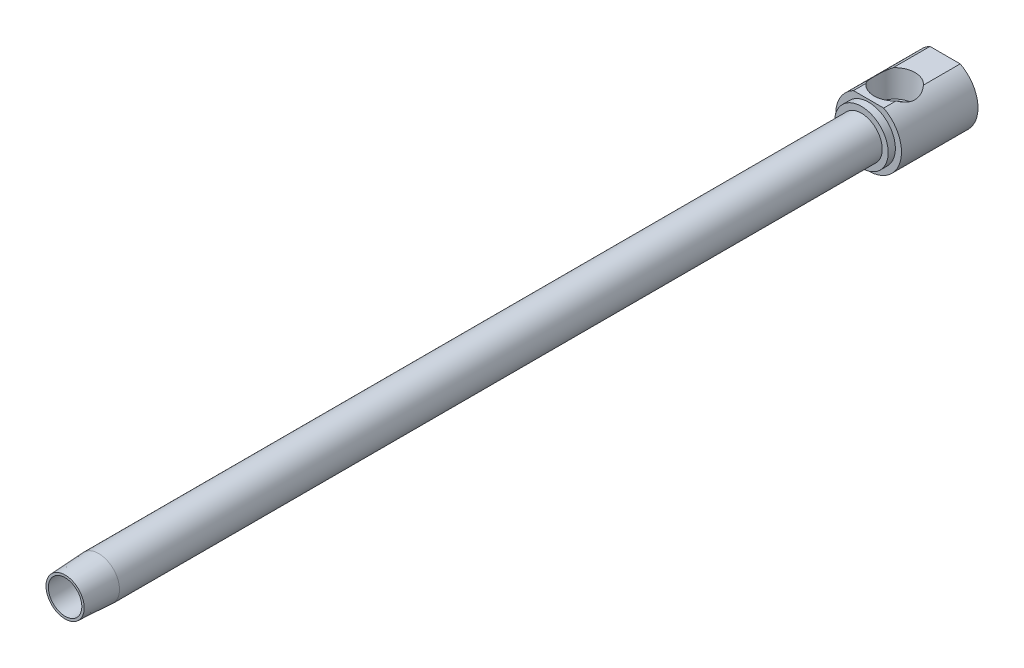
ISO-10303-21;
HEADER;
FILE_DESCRIPTION(('STEP AP214'),'2;1');
FILE_NAME('part.step','',(''),(''),'','','');
FILE_SCHEMA(('AUTOMOTIVE_DESIGN { 1 0 10303 214 1 1 1 1 }'));
ENDSEC;
DATA;
#1=APPLICATION_CONTEXT('core data for automotive mechanical design processes');
#2=APPLICATION_PROTOCOL_DEFINITION('international standard','automotive_design',2000,#1);
#3=PRODUCT_CONTEXT('',#1,'mechanical');
#4=PRODUCT('Part','Part','',(#3));
#5=PRODUCT_RELATED_PRODUCT_CATEGORY('part','',(#4));
#6=PRODUCT_DEFINITION_FORMATION('','',#4);
#7=PRODUCT_DEFINITION_CONTEXT('part definition',#1,'design');
#8=PRODUCT_DEFINITION('design','',#6,#7);
#9=PRODUCT_DEFINITION_SHAPE('','',#8);
#10=(LENGTH_UNIT() NAMED_UNIT(*) SI_UNIT(.MILLI.,.METRE.));
#11=(NAMED_UNIT(*) PLANE_ANGLE_UNIT() SI_UNIT($,.RADIAN.));
#12=(NAMED_UNIT(*) SI_UNIT($,.STERADIAN.) SOLID_ANGLE_UNIT());
#13=UNCERTAINTY_MEASURE_WITH_UNIT(LENGTH_MEASURE(1.E-05),#10,'distance_accuracy_value','');
#14=(GEOMETRIC_REPRESENTATION_CONTEXT(3) GLOBAL_UNCERTAINTY_ASSIGNED_CONTEXT((#13)) GLOBAL_UNIT_ASSIGNED_CONTEXT((#10,
#11,#12)) REPRESENTATION_CONTEXT('',''));
#15=CARTESIAN_POINT('',(0.,0.,0.));
#16=DIRECTION('',(0.,0.,1.));
#17=DIRECTION('',(1.,0.,0.));
#18=AXIS2_PLACEMENT_3D('',#15,#16,#17);
#19=CARTESIAN_POINT('',(0.,0.,-326.022166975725));
#20=DIRECTION('',(0.,0.,-1.));
#21=DIRECTION('',(-1.,0.,0.));
#22=AXIS2_PLACEMENT_3D('',#19,#20,#21);
#23=CYLINDRICAL_SURFACE('',#22,6.9215);
#24=CARTESIAN_POINT('',(0.,0.,-11.147200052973));
#25=DIRECTION('',(0.,0.,-1.));
#26=DIRECTION('',(-1.,0.,0.));
#27=AXIS2_PLACEMENT_3D('',#24,#25,#26);
#28=CIRCLE('',#27,6.9215);
#29=CARTESIAN_POINT('',(-6.9215,0.,-11.147200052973));
#30=VERTEX_POINT('',#29);
#31=EDGE_CURVE('E260',#30,#30,#28,.T.);
#32=ORIENTED_EDGE('',*,*,#31,.T.);
#33=EDGE_LOOP('',(#32));
#34=FACE_BOUND('',#33,.T.);
#35=CARTESIAN_POINT('',(0.,0.,-264.3124));
#36=DIRECTION('',(0.,0.,-1.));
#37=DIRECTION('',(-1.,0.,0.));
#38=AXIS2_PLACEMENT_3D('',#35,#36,#37);
#39=CIRCLE('',#38,6.9215);
#40=CARTESIAN_POINT('',(-6.9215,0.,-264.3124));
#41=VERTEX_POINT('',#40);
#42=EDGE_CURVE('E230',#41,#41,#39,.T.);
#43=ORIENTED_EDGE('',*,*,#42,.F.);
#44=EDGE_LOOP('',(#43));
#45=FACE_BOUND('',#44,.T.);
#46=ADVANCED_FACE('F15',(#34,#45),#23,.T.);
#47=CARTESIAN_POINT('',(-5.0165,9.70179425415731,-250.825));
#48=DIRECTION('',(0.,-1.,0.));
#49=DIRECTION('',(0.,0.,-1.));
#50=AXIS2_PLACEMENT_3D('',#47,#48,#49);
#51=PLANE('',#50);
#52=DIRECTION('',(0.,0.,-1.));
#53=VECTOR('',#52,1.);
#54=CARTESIAN_POINT('',(5.0165,9.70179425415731,-250.825));
#55=LINE('',#54,#53);
#56=CARTESIAN_POINT('',(5.0165,9.70179425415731,-266.7));
#57=VERTEX_POINT('',#56);
#58=CARTESIAN_POINT('',(5.0165,9.70179425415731,-270.78066390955));
#59=VERTEX_POINT('',#58);
#60=EDGE_CURVE('E222',#57,#59,#55,.T.);
#61=ORIENTED_EDGE('',*,*,#60,.T.);
#62=CARTESIAN_POINT('',(0.,9.70179425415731,-275.336));
#63=DIRECTION('',(0.,-1.,0.));
#64=DIRECTION('',(0.,0.,-1.));
#65=AXIS2_PLACEMENT_3D('',#62,#63,#64);
#66=CIRCLE('',#65,6.77616109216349);
#67=CARTESIAN_POINT('',(-5.0165,9.70179425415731,-270.78066390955));
#68=VERTEX_POINT('',#67);
#69=EDGE_CURVE('E10',#59,#68,#66,.T.);
#70=ORIENTED_EDGE('',*,*,#69,.T.);
#71=DIRECTION('',(0.,0.,-1.));
#72=VECTOR('',#71,1.);
#73=CARTESIAN_POINT('',(-5.0165,9.70179425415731,-250.825));
#74=LINE('',#73,#72);
#75=CARTESIAN_POINT('',(-5.0165,9.70179425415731,-266.7));
#76=VERTEX_POINT('',#75);
#77=EDGE_CURVE('E229',#76,#68,#74,.T.);
#78=ORIENTED_EDGE('',*,*,#77,.F.);
#79=DIRECTION('',(1.,0.,0.));
#80=VECTOR('',#79,1.);
#81=CARTESIAN_POINT('',(-8.89,9.70179425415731,-266.7));
#82=LINE('',#81,#80);
#83=EDGE_CURVE('E192',#76,#57,#82,.T.);
#84=ORIENTED_EDGE('',*,*,#83,.T.);
#85=EDGE_LOOP('',(#61,#70,#78,#84));
#86=FACE_BOUND('',#85,.T.);
#87=ADVANCED_FACE('F128',(#86),#51,.F.);
#88=CARTESIAN_POINT('',(-5.55625,0.,-264.287));
#89=DIRECTION('',(0.,0.,1.));
#90=DIRECTION('',(1.,0.,0.));
#91=AXIS2_PLACEMENT_3D('',#88,#89,#90);
#92=PLANE('',#91);
#93=CARTESIAN_POINT('',(0.,0.,-264.287));
#94=DIRECTION('',(0.,0.,-1.));
#95=DIRECTION('',(-1.,0.,0.));
#96=AXIS2_PLACEMENT_3D('',#93,#94,#95);
#97=CIRCLE('',#96,5.55625);
#98=CARTESIAN_POINT('',(-5.55625,0.,-264.287));
#99=VERTEX_POINT('',#98);
#100=EDGE_CURVE('E243',#99,#99,#97,.T.);
#101=ORIENTED_EDGE('',*,*,#100,.F.);
#102=EDGE_LOOP('',(#101));
#103=FACE_BOUND('',#102,.T.);
#104=CARTESIAN_POINT('',(0.,-0.00757924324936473,-264.287));
#105=DIRECTION('',(0.,0.,1.));
#106=DIRECTION('',(0.,1.,0.));
#107=AXIS2_PLACEMENT_3D('',#104,#105,#106);
#108=ELLIPSE('',#107,5.22919092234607,4.47866855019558);
#109=CARTESIAN_POINT('',(0.,5.22161167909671,-264.287));
#110=VERTEX_POINT('',#109);
#111=EDGE_CURVE('E193',#110,#110,#108,.F.);
#112=ORIENTED_EDGE('',*,*,#111,.T.);
#113=EDGE_LOOP('',(#112));
#114=FACE_BOUND('',#113,.T.);
#115=ADVANCED_FACE('F134',(#103,#114),#92,.T.);
#116=CARTESIAN_POINT('',(-5.55625,0.,0.));
#117=DIRECTION('',(0.,0.,1.));
#118=DIRECTION('',(1.,0.,0.));
#119=AXIS2_PLACEMENT_3D('',#116,#117,#118);
#120=PLANE('',#119);
#121=CARTESIAN_POINT('',(0.,0.,0.));
#122=DIRECTION('',(0.,0.,-1.));
#123=DIRECTION('',(-1.,0.,0.));
#124=AXIS2_PLACEMENT_3D('',#121,#122,#123);
#125=CIRCLE('',#124,6.3373);
#126=CARTESIAN_POINT('',(-6.3373,0.,0.));
#127=VERTEX_POINT('',#126);
#128=EDGE_CURVE('E257',#127,#127,#125,.T.);
#129=ORIENTED_EDGE('',*,*,#128,.F.);
#130=EDGE_LOOP('',(#129));
#131=FACE_BOUND('',#130,.T.);
#132=CARTESIAN_POINT('',(0.,0.,0.));
#133=DIRECTION('',(0.,0.,-1.));
#134=DIRECTION('',(-1.,0.,0.));
#135=AXIS2_PLACEMENT_3D('',#132,#133,#134);
#136=CIRCLE('',#135,5.55625);
#137=CARTESIAN_POINT('',(-5.55625,0.,0.));
#138=VERTEX_POINT('',#137);
#139=EDGE_CURVE('E19',#138,#138,#136,.T.);
#140=ORIENTED_EDGE('',*,*,#139,.T.);
#141=EDGE_LOOP('',(#140));
#142=FACE_BOUND('',#141,.T.);
#143=ADVANCED_FACE('F17',(#131,#142),#120,.T.);
#144=CARTESIAN_POINT('',(0.,0.,-326.022166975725));
#145=DIRECTION('',(0.,0.,-1.));
#146=DIRECTION('',(-1.,0.,0.));
#147=AXIS2_PLACEMENT_3D('',#144,#145,#146);
#148=CYLINDRICAL_SURFACE('',#147,5.55625);
#149=ORIENTED_EDGE('',*,*,#100,.T.);
#150=EDGE_LOOP('',(#149));
#151=FACE_BOUND('',#150,.T.);
#152=ORIENTED_EDGE('',*,*,#139,.F.);
#153=EDGE_LOOP('',(#152));
#154=FACE_BOUND('',#153,.T.);
#155=ADVANCED_FACE('F141',(#151,#154),#148,.F.);
#156=CARTESIAN_POINT('',(-10.922,0.,-292.1));
#157=DIRECTION('',(0.,0.,-1.));
#158=DIRECTION('',(-1.,0.,0.));
#159=AXIS2_PLACEMENT_3D('',#156,#157,#158);
#160=PLANE('',#159);
#161=DIRECTION('',(1.,0.,0.));
#162=VECTOR('',#161,1.);
#163=CARTESIAN_POINT('',(-2.7496306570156,4.7625,-292.1));
#164=LINE('',#163,#162);
#165=CARTESIAN_POINT('',(-2.7496306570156,4.7625,-292.1));
#166=VERTEX_POINT('',#165);
#167=CARTESIAN_POINT('',(2.7496306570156,4.7625,-292.1));
#168=VERTEX_POINT('',#167);
#169=EDGE_CURVE('E353',#166,#168,#164,.T.);
#170=ORIENTED_EDGE('',*,*,#169,.F.);
#171=DIRECTION('',(0.5,0.866025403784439,0.));
#172=VECTOR('',#171,1.);
#173=CARTESIAN_POINT('',(-5.49926131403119,0.,-292.1));
#174=LINE('',#173,#172);
#175=CARTESIAN_POINT('',(-5.49926131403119,0.,-292.1));
#176=VERTEX_POINT('',#175);
#177=EDGE_CURVE('E338',#176,#166,#174,.T.);
#178=ORIENTED_EDGE('',*,*,#177,.F.);
#179=DIRECTION('',(-0.5,0.866025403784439,0.));
#180=VECTOR('',#179,1.);
#181=CARTESIAN_POINT('',(-2.7496306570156,-4.7625,-292.1));
#182=LINE('',#181,#180);
#183=CARTESIAN_POINT('',(-2.7496306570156,-4.7625,-292.1));
#184=VERTEX_POINT('',#183);
#185=EDGE_CURVE('E342',#184,#176,#182,.T.);
#186=ORIENTED_EDGE('',*,*,#185,.F.);
#187=DIRECTION('',(-1.,0.,0.));
#188=VECTOR('',#187,1.);
#189=CARTESIAN_POINT('',(2.74963065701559,-4.7625,-292.1));
#190=LINE('',#189,#188);
#191=CARTESIAN_POINT('',(2.74963065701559,-4.7625,-292.1));
#192=VERTEX_POINT('',#191);
#193=EDGE_CURVE('E361',#192,#184,#190,.T.);
#194=ORIENTED_EDGE('',*,*,#193,.F.);
#195=DIRECTION('',(-0.5,-0.866025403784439,0.));
#196=VECTOR('',#195,1.);
#197=CARTESIAN_POINT('',(5.49926131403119,0.,-292.1));
#198=LINE('',#197,#196);
#199=CARTESIAN_POINT('',(5.49926131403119,0.,-292.1));
#200=VERTEX_POINT('',#199);
#201=EDGE_CURVE('E358',#200,#192,#198,.T.);
#202=ORIENTED_EDGE('',*,*,#201,.F.);
#203=DIRECTION('',(0.5,-0.866025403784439,0.));
#204=VECTOR('',#203,1.);
#205=CARTESIAN_POINT('',(2.7496306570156,4.7625,-292.1));
#206=LINE('',#205,#204);
#207=EDGE_CURVE('E355',#168,#200,#206,.T.);
#208=ORIENTED_EDGE('',*,*,#207,.F.);
#209=EDGE_LOOP('',(#170,#178,#186,#194,#202,#208));
#210=FACE_BOUND('',#209,.T.);
#211=DIRECTION('',(-1.,0.,0.));
#212=VECTOR('',#211,1.);
#213=CARTESIAN_POINT('',(-5.0165,9.70179425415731,-292.1));
#214=LINE('',#213,#212);
#215=CARTESIAN_POINT('',(5.0165,9.70179425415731,-292.1));
#216=VERTEX_POINT('',#215);
#217=CARTESIAN_POINT('',(-5.0165,9.70179425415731,-292.1));
#218=VERTEX_POINT('',#217);
#219=EDGE_CURVE('E223',#216,#218,#214,.T.);
#220=ORIENTED_EDGE('',*,*,#219,.F.);
#221=CARTESIAN_POINT('',(0.,0.,-292.1));
#222=DIRECTION('',(0.,0.,-1.));
#223=DIRECTION('',(-1.,0.,0.));
#224=AXIS2_PLACEMENT_3D('',#221,#222,#223);
#225=CIRCLE('',#224,10.922);
#226=EDGE_CURVE('E221',#216,#218,#225,.T.);
#227=ORIENTED_EDGE('',*,*,#226,.T.);
#228=EDGE_LOOP('',(#220,#227));
#229=FACE_BOUND('',#228,.T.);
#230=ADVANCED_FACE('F144',(#210,#229),#160,.T.);
#231=CARTESIAN_POINT('',(0.,0.,-326.022166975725));
#232=DIRECTION('',(0.,0.,-1.));
#233=DIRECTION('',(-1.,0.,0.));
#234=AXIS2_PLACEMENT_3D('',#231,#232,#233);
#235=CYLINDRICAL_SURFACE('',#234,10.922);
#236=CARTESIAN_POINT('',(5.01611318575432,9.70199425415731,-270.780222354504));
#237=CARTESIAN_POINT('',(5.13874600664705,9.63860171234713,-270.920215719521));
#238=CARTESIAN_POINT('',(5.25564164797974,9.57520664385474,-271.065256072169));
#239=CARTESIAN_POINT('',(5.47752086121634,9.45002813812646,-271.364981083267));
#240=CARTESIAN_POINT('',(5.58249714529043,9.38824570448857,-271.519671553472));
#241=CARTESIAN_POINT('',(5.78097274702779,9.26736711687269,-271.839725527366));
#242=CARTESIAN_POINT('',(5.8743418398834,9.20830544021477,-272.00518303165));
#243=CARTESIAN_POINT('',(6.04766375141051,9.09541327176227,-272.344678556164));
#244=CARTESIAN_POINT('',(6.12761848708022,9.04158203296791,-272.518715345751));
#245=CARTESIAN_POINT('',(6.27379640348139,8.94077724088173,-272.875643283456));
#246=CARTESIAN_POINT('',(6.33993919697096,8.89384428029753,-273.058579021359));
#247=CARTESIAN_POINT('',(6.45706504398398,8.80917858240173,-273.431294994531));
#248=CARTESIAN_POINT('',(6.50805163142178,8.7714437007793,-273.621073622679));
#249=CARTESIAN_POINT('',(6.59383346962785,8.70714156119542,-274.005114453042));
#250=CARTESIAN_POINT('',(6.62870831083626,8.68051947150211,-274.199349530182));
#251=CARTESIAN_POINT('',(6.68193856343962,8.63961377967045,-274.591343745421));
#252=CARTESIAN_POINT('',(6.70029794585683,8.6253272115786,-274.789102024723));
#253=CARTESIAN_POINT('',(6.71863048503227,8.61105017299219,-275.15650037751));
#254=CARTESIAN_POINT('',(6.72092722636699,8.6092532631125,-275.325959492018));
#255=CARTESIAN_POINT('',(6.71322085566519,8.61526418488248,-275.664414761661));
#256=CARTESIAN_POINT('',(6.70321892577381,8.6230710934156,-275.833410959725));
#257=CARTESIAN_POINT('',(6.67106070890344,8.64797346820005,-276.169752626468));
#258=CARTESIAN_POINT('',(6.64888985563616,8.66508006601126,-276.337095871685));
#259=CARTESIAN_POINT('',(6.59274566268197,8.70787088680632,-276.668631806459));
#260=CARTESIAN_POINT('',(6.55877214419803,8.73355523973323,-276.832824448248));
#261=CARTESIAN_POINT('',(6.44503992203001,8.81817206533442,-277.297696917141));
#262=CARTESIAN_POINT('',(6.35112179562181,8.88662503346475,-277.593302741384));
#263=CARTESIAN_POINT('',(6.1270275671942,9.04257250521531,-278.164869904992));
#264=CARTESIAN_POINT('',(5.99683851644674,9.13007380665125,-278.440824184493));
#265=CARTESIAN_POINT('',(5.73165005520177,9.2982747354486,-278.918944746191));
#266=CARTESIAN_POINT('',(5.60244827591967,9.37701803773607,-279.125061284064));
#267=CARTESIAN_POINT('',(5.32402625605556,9.53785679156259,-279.520821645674));
#268=CARTESIAN_POINT('',(5.1748707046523,9.61994083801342,-279.710515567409));
#269=CARTESIAN_POINT('',(5.01611318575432,9.70199425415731,-279.891777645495));
#270=B_SPLINE_CURVE_WITH_KNOTS('',3,(#236,#237,#238,#239,#240,#241,#242,#243,#244,#245,#246,
#247,#248,#249,#250,#251,#252,#253,#254,#255,#256,#257,#258,#259,#260,#261,#262,#263,#264,#265,
#266,#267,#268,#269),.UNSPECIFIED.,.F.,.F.,(4,2,2,2,2,2,2,2,2,2,2,2,2,2,2,2,4),(0.,
0.589708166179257,1.17977497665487,1.77595731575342,2.37205438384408,2.97152964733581,
3.57086502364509,4.16720722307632,4.7634059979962,5.2711570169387,5.77885923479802,
6.28717050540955,6.79548947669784,7.7444750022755,8.69379975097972,9.45956340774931,
10.222902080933),.UNSPECIFIED.);
#271=CARTESIAN_POINT('',(5.0165,9.70179425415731,-279.891336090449));
#272=VERTEX_POINT('',#271);
#273=EDGE_CURVE('E31',#59,#272,#270,.T.);
#274=ORIENTED_EDGE('',*,*,#273,.F.);
#275=ORIENTED_EDGE('',*,*,#60,.F.);
#276=CARTESIAN_POINT('',(0.,0.,-266.7));
#277=DIRECTION('',(0.,0.,-1.));
#278=DIRECTION('',(-1.,0.,0.));
#279=AXIS2_PLACEMENT_3D('',#276,#277,#278);
#280=CIRCLE('',#279,10.922);
#281=EDGE_CURVE('E239',#57,#76,#280,.T.);
#282=ORIENTED_EDGE('',*,*,#281,.T.);
#283=ORIENTED_EDGE('',*,*,#77,.T.);
#284=CARTESIAN_POINT('',(-5.01611318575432,9.70199425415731,-279.891777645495));
#285=CARTESIAN_POINT('',(-5.13874600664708,9.63860171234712,-279.751784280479));
#286=CARTESIAN_POINT('',(-5.25564164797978,9.57520664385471,-279.606743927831));
#287=CARTESIAN_POINT('',(-5.47752086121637,9.45002813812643,-279.307018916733));
#288=CARTESIAN_POINT('',(-5.58249714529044,9.38824570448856,-279.152328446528));
#289=CARTESIAN_POINT('',(-5.78097274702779,9.26736711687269,-278.832274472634));
#290=CARTESIAN_POINT('',(-5.8743418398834,9.20830544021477,-278.66681696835));
#291=CARTESIAN_POINT('',(-6.04766375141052,9.09541327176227,-278.327321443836));
#292=CARTESIAN_POINT('',(-6.12761848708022,9.04158203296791,-278.153284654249));
#293=CARTESIAN_POINT('',(-6.27379640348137,8.94077724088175,-277.796356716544));
#294=CARTESIAN_POINT('',(-6.33993919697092,8.89384428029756,-277.613420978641));
#295=CARTESIAN_POINT('',(-6.45706504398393,8.80917858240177,-277.240705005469));
#296=CARTESIAN_POINT('',(-6.50805163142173,8.77144370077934,-277.050926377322));
#297=CARTESIAN_POINT('',(-6.5938334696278,8.70714156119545,-276.666885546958));
#298=CARTESIAN_POINT('',(-6.62870831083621,8.68051947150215,-276.472650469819));
#299=CARTESIAN_POINT('',(-6.68193856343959,8.63961377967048,-276.08065625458));
#300=CARTESIAN_POINT('',(-6.70029794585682,8.62532721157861,-275.882897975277));
#301=CARTESIAN_POINT('',(-6.71863048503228,8.61105017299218,-275.51549962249));
#302=CARTESIAN_POINT('',(-6.72092722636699,8.60925326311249,-275.346040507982));
#303=CARTESIAN_POINT('',(-6.7132208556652,8.61526418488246,-275.00758523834));
#304=CARTESIAN_POINT('',(-6.70321892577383,8.62307109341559,-274.838589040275));
#305=CARTESIAN_POINT('',(-6.67106070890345,8.64797346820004,-274.502247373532));
#306=CARTESIAN_POINT('',(-6.64888985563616,8.66508006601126,-274.334904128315));
#307=CARTESIAN_POINT('',(-6.59274566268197,8.70787088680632,-274.003368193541));
#308=CARTESIAN_POINT('',(-6.55877214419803,8.73355523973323,-273.839175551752));
#309=CARTESIAN_POINT('',(-6.44503992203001,8.81817206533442,-273.374303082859));
#310=CARTESIAN_POINT('',(-6.35112179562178,8.88662503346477,-273.078697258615));
#311=CARTESIAN_POINT('',(-6.12702756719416,9.04257250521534,-272.507130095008));
#312=CARTESIAN_POINT('',(-5.99683851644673,9.13007380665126,-272.231175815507));
#313=CARTESIAN_POINT('',(-5.73165005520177,9.2982747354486,-271.753055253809));
#314=CARTESIAN_POINT('',(-5.60244827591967,9.37701803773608,-271.546938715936));
#315=CARTESIAN_POINT('',(-5.32402625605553,9.5378567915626,-271.151178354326));
#316=CARTESIAN_POINT('',(-5.17487070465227,9.61994083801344,-270.961484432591));
#317=CARTESIAN_POINT('',(-5.01611318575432,9.70199425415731,-270.780222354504));
#318=B_SPLINE_CURVE_WITH_KNOTS('',3,(#284,#285,#286,#287,#288,#289,#290,#291,#292,#293,#294,
#295,#296,#297,#298,#299,#300,#301,#302,#303,#304,#305,#306,#307,#308,#309,#310,#311,#312,#313,
#314,#315,#316,#317),.UNSPECIFIED.,.F.,.F.,(4,2,2,2,2,2,2,2,2,2,2,2,2,2,2,2,4),(0.,
0.589708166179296,1.17977497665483,1.77595731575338,2.37205438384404,2.97152964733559,
3.57086502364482,4.16720722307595,4.76340599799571,5.27115701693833,5.77885923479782,
6.28717050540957,6.79548947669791,7.74447500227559,8.69379975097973,9.45956340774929,
10.222902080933),.UNSPECIFIED.);
#319=CARTESIAN_POINT('',(-5.0165,9.70179425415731,-279.891336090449));
#320=VERTEX_POINT('',#319);
#321=EDGE_CURVE('E161',#320,#68,#318,.T.);
#322=ORIENTED_EDGE('',*,*,#321,.F.);
#323=EDGE_CURVE('E215',#320,#218,#74,.T.);
#324=ORIENTED_EDGE('',*,*,#323,.T.);
#325=ORIENTED_EDGE('',*,*,#226,.F.);
#326=EDGE_CURVE('E213',#272,#216,#55,.T.);
#327=ORIENTED_EDGE('',*,*,#326,.F.);
#328=EDGE_LOOP('',(#274,#275,#282,#283,#322,#324,#325,#327));
#329=FACE_BOUND('',#328,.T.);
#330=ADVANCED_FACE('F151',(#329),#235,.T.);
#331=CARTESIAN_POINT('',(-8.89,0.,-266.7));
#332=DIRECTION('',(0.,0.,1.));
#333=DIRECTION('',(1.,0.,0.));
#334=AXIS2_PLACEMENT_3D('',#331,#332,#333);
#335=PLANE('',#334);
#336=ORIENTED_EDGE('',*,*,#83,.F.);
#337=ORIENTED_EDGE('',*,*,#281,.F.);
#338=EDGE_LOOP('',(#336,#337));
#339=FACE_BOUND('',#338,.T.);
#340=CARTESIAN_POINT('',(0.,0.,-266.7));
#341=DIRECTION('',(0.,0.,-1.));
#342=DIRECTION('',(-1.,0.,0.));
#343=AXIS2_PLACEMENT_3D('',#340,#341,#342);
#344=CIRCLE('',#343,8.89);
#345=CARTESIAN_POINT('',(-8.89,0.,-266.7));
#346=VERTEX_POINT('',#345);
#347=EDGE_CURVE('E236',#346,#346,#344,.T.);
#348=ORIENTED_EDGE('',*,*,#347,.T.);
#349=EDGE_LOOP('',(#348));
#350=FACE_BOUND('',#349,.T.);
#351=ADVANCED_FACE('F156',(#339,#350),#335,.T.);
#352=CARTESIAN_POINT('',(0.,0.,-326.022166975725));
#353=DIRECTION('',(0.,0.,-1.));
#354=DIRECTION('',(-1.,0.,0.));
#355=AXIS2_PLACEMENT_3D('',#352,#353,#354);
#356=CYLINDRICAL_SURFACE('',#355,8.89);
#357=CARTESIAN_POINT('',(0.,0.,-264.3124));
#358=DIRECTION('',(0.,0.,-1.));
#359=DIRECTION('',(-1.,0.,0.));
#360=AXIS2_PLACEMENT_3D('',#357,#358,#359);
#361=CIRCLE('',#360,8.89);
#362=CARTESIAN_POINT('',(-8.89,0.,-264.3124));
#363=VERTEX_POINT('',#362);
#364=EDGE_CURVE('E233',#363,#363,#361,.T.);
#365=ORIENTED_EDGE('',*,*,#364,.T.);
#366=EDGE_LOOP('',(#365));
#367=FACE_BOUND('',#366,.T.);
#368=ORIENTED_EDGE('',*,*,#347,.F.);
#369=EDGE_LOOP('',(#368));
#370=FACE_BOUND('',#369,.T.);
#371=ADVANCED_FACE('F282',(#367,#370),#356,.T.);
#372=CARTESIAN_POINT('',(-6.9215,0.,-264.3124));
#373=DIRECTION('',(0.,0.,1.));
#374=DIRECTION('',(1.,0.,0.));
#375=AXIS2_PLACEMENT_3D('',#372,#373,#374);
#376=PLANE('',#375);
#377=ORIENTED_EDGE('',*,*,#42,.T.);
#378=EDGE_LOOP('',(#377));
#379=FACE_BOUND('',#378,.T.);
#380=ORIENTED_EDGE('',*,*,#364,.F.);
#381=EDGE_LOOP('',(#380));
#382=FACE_BOUND('',#381,.T.);
#383=ADVANCED_FACE('F286',(#379,#382),#376,.T.);
#384=ORIENTED_EDGE('',*,*,#323,.F.);
#385=EDGE_CURVE('E24',#320,#272,#66,.T.);
#386=ORIENTED_EDGE('',*,*,#385,.T.);
#387=ORIENTED_EDGE('',*,*,#326,.T.);
#388=ORIENTED_EDGE('',*,*,#219,.T.);
#389=EDGE_LOOP('',(#384,#386,#387,#388));
#390=FACE_BOUND('',#389,.T.);
#391=ADVANCED_FACE('F137',(#390),#51,.F.);
#392=CARTESIAN_POINT('',(-2.7496306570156,4.7625,-285.75));
#393=DIRECTION('',(0.,1.,0.));
#394=DIRECTION('',(0.,0.,1.));
#395=AXIS2_PLACEMENT_3D('',#392,#393,#394);
#396=PLANE('',#395);
#397=ORIENTED_EDGE('',*,*,#169,.T.);
#398=DIRECTION('',(0.,0.,-1.));
#399=VECTOR('',#398,1.);
#400=CARTESIAN_POINT('',(2.7496306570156,4.7625,-285.75));
#401=LINE('',#400,#399);
#402=CARTESIAN_POINT('',(2.7496306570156,4.7625,-285.75));
#403=VERTEX_POINT('',#402);
#404=EDGE_CURVE('E352',#403,#168,#401,.T.);
#405=ORIENTED_EDGE('',*,*,#404,.F.);
#406=DIRECTION('',(1.,0.,0.));
#407=VECTOR('',#406,1.);
#408=CARTESIAN_POINT('',(-2.7496306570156,4.7625,-285.75));
#409=LINE('',#408,#407);
#410=CARTESIAN_POINT('',(-2.7496306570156,4.7625,-285.75));
#411=VERTEX_POINT('',#410);
#412=EDGE_CURVE('E331',#411,#403,#409,.T.);
#413=ORIENTED_EDGE('',*,*,#412,.F.);
#414=DIRECTION('',(0.,0.,-1.));
#415=VECTOR('',#414,1.);
#416=CARTESIAN_POINT('',(-2.7496306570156,4.7625,-285.75));
#417=LINE('',#416,#415);
#418=EDGE_CURVE('E225',#411,#166,#417,.T.);
#419=ORIENTED_EDGE('',*,*,#418,.T.);
#420=EDGE_LOOP('',(#397,#405,#413,#419));
#421=FACE_BOUND('',#420,.T.);
#422=ADVANCED_FACE('F296',(#421),#396,.F.);
#423=CARTESIAN_POINT('',(-5.49926131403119,0.,-285.75));
#424=DIRECTION('',(-0.866025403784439,0.5,0.));
#425=DIRECTION('',(-0.5,-0.866025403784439,0.));
#426=AXIS2_PLACEMENT_3D('',#423,#424,#425);
#427=PLANE('',#426);
#428=ORIENTED_EDGE('',*,*,#177,.T.);
#429=ORIENTED_EDGE('',*,*,#418,.F.);
#430=DIRECTION('',(0.5,0.866025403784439,0.));
#431=VECTOR('',#430,1.);
#432=CARTESIAN_POINT('',(-5.49926131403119,0.,-285.75));
#433=LINE('',#432,#431);
#434=CARTESIAN_POINT('',(-5.49926131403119,0.,-285.75));
#435=VERTEX_POINT('',#434);
#436=EDGE_CURVE('E337',#435,#411,#433,.T.);
#437=ORIENTED_EDGE('',*,*,#436,.F.);
#438=DIRECTION('',(0.,0.,-1.));
#439=VECTOR('',#438,1.);
#440=CARTESIAN_POINT('',(-5.49926131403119,0.,-285.75));
#441=LINE('',#440,#439);
#442=EDGE_CURVE('E367',#435,#176,#441,.T.);
#443=ORIENTED_EDGE('',*,*,#442,.T.);
#444=EDGE_LOOP('',(#428,#429,#437,#443));
#445=FACE_BOUND('',#444,.T.);
#446=ADVANCED_FACE('F299',(#445),#427,.F.);
#447=CARTESIAN_POINT('',(-2.7496306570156,-4.7625,-285.75));
#448=DIRECTION('',(-0.866025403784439,-0.5,0.));
#449=DIRECTION('',(0.5,-0.866025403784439,0.));
#450=AXIS2_PLACEMENT_3D('',#447,#448,#449);
#451=PLANE('',#450);
#452=ORIENTED_EDGE('',*,*,#185,.T.);
#453=ORIENTED_EDGE('',*,*,#442,.F.);
#454=DIRECTION('',(-0.5,0.866025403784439,0.));
#455=VECTOR('',#454,1.);
#456=CARTESIAN_POINT('',(-2.7496306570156,-4.7625,-285.75));
#457=LINE('',#456,#455);
#458=CARTESIAN_POINT('',(-2.7496306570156,-4.7625,-285.75));
#459=VERTEX_POINT('',#458);
#460=EDGE_CURVE('E349',#459,#435,#457,.T.);
#461=ORIENTED_EDGE('',*,*,#460,.F.);
#462=DIRECTION('',(0.,0.,-1.));
#463=VECTOR('',#462,1.);
#464=CARTESIAN_POINT('',(-2.7496306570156,-4.7625,-285.75));
#465=LINE('',#464,#463);
#466=EDGE_CURVE('E369',#459,#184,#465,.T.);
#467=ORIENTED_EDGE('',*,*,#466,.T.);
#468=EDGE_LOOP('',(#452,#453,#461,#467));
#469=FACE_BOUND('',#468,.T.);
#470=ADVANCED_FACE('F313',(#469),#451,.F.);
#471=CARTESIAN_POINT('',(2.74963065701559,-4.7625,-285.75));
#472=DIRECTION('',(0.,-1.,0.));
#473=DIRECTION('',(1.,0.,0.));
#474=AXIS2_PLACEMENT_3D('',#471,#472,#473);
#475=PLANE('',#474);
#476=ORIENTED_EDGE('',*,*,#193,.T.);
#477=ORIENTED_EDGE('',*,*,#466,.F.);
#478=DIRECTION('',(-1.,0.,0.));
#479=VECTOR('',#478,1.);
#480=CARTESIAN_POINT('',(2.74963065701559,-4.7625,-285.75));
#481=LINE('',#480,#479);
#482=CARTESIAN_POINT('',(2.74963065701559,-4.7625,-285.75));
#483=VERTEX_POINT('',#482);
#484=EDGE_CURVE('E346',#483,#459,#481,.T.);
#485=ORIENTED_EDGE('',*,*,#484,.F.);
#486=DIRECTION('',(0.,0.,-1.));
#487=VECTOR('',#486,1.);
#488=CARTESIAN_POINT('',(2.74963065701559,-4.7625,-285.75));
#489=LINE('',#488,#487);
#490=EDGE_CURVE('E371',#483,#192,#489,.T.);
#491=ORIENTED_EDGE('',*,*,#490,.T.);
#492=EDGE_LOOP('',(#476,#477,#485,#491));
#493=FACE_BOUND('',#492,.T.);
#494=ADVANCED_FACE('F309',(#493),#475,.F.);
#495=CARTESIAN_POINT('',(5.49926131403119,0.,-285.75));
#496=DIRECTION('',(0.866025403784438,-0.5,0.));
#497=DIRECTION('',(0.5,0.866025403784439,0.));
#498=AXIS2_PLACEMENT_3D('',#495,#496,#497);
#499=PLANE('',#498);
#500=ORIENTED_EDGE('',*,*,#201,.T.);
#501=ORIENTED_EDGE('',*,*,#490,.F.);
#502=DIRECTION('',(-0.5,-0.866025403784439,0.));
#503=VECTOR('',#502,1.);
#504=CARTESIAN_POINT('',(5.49926131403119,0.,-285.75));
#505=LINE('',#504,#503);
#506=CARTESIAN_POINT('',(5.49926131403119,0.,-285.75));
#507=VERTEX_POINT('',#506);
#508=EDGE_CURVE('E339',#507,#483,#505,.T.);
#509=ORIENTED_EDGE('',*,*,#508,.F.);
#510=DIRECTION('',(0.,0.,-1.));
#511=VECTOR('',#510,1.);
#512=CARTESIAN_POINT('',(5.49926131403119,0.,-285.75));
#513=LINE('',#512,#511);
#514=EDGE_CURVE('E373',#507,#200,#513,.T.);
#515=ORIENTED_EDGE('',*,*,#514,.T.);
#516=EDGE_LOOP('',(#500,#501,#509,#515));
#517=FACE_BOUND('',#516,.T.);
#518=ADVANCED_FACE('F305',(#517),#499,.F.);
#519=CARTESIAN_POINT('',(2.7496306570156,4.7625,-285.75));
#520=DIRECTION('',(0.866025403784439,0.5,0.));
#521=DIRECTION('',(-0.5,0.866025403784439,0.));
#522=AXIS2_PLACEMENT_3D('',#519,#520,#521);
#523=PLANE('',#522);
#524=ORIENTED_EDGE('',*,*,#207,.T.);
#525=ORIENTED_EDGE('',*,*,#514,.F.);
#526=DIRECTION('',(0.5,-0.866025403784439,0.));
#527=VECTOR('',#526,1.);
#528=CARTESIAN_POINT('',(2.7496306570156,4.7625,-285.75));
#529=LINE('',#528,#527);
#530=EDGE_CURVE('E334',#403,#507,#529,.T.);
#531=ORIENTED_EDGE('',*,*,#530,.F.);
#532=ORIENTED_EDGE('',*,*,#404,.T.);
#533=EDGE_LOOP('',(#524,#525,#531,#532));
#534=FACE_BOUND('',#533,.T.);
#535=ADVANCED_FACE('F301',(#534),#523,.F.);
#536=CARTESIAN_POINT('',(0.,0.,-285.75));
#537=DIRECTION('',(0.,0.,-1.));
#538=DIRECTION('',(-1.,0.,0.));
#539=AXIS2_PLACEMENT_3D('',#536,#537,#538);
#540=PLANE('',#539);
#541=ORIENTED_EDGE('',*,*,#412,.T.);
#542=ORIENTED_EDGE('',*,*,#530,.T.);
#543=ORIENTED_EDGE('',*,*,#508,.T.);
#544=ORIENTED_EDGE('',*,*,#484,.T.);
#545=ORIENTED_EDGE('',*,*,#460,.T.);
#546=ORIENTED_EDGE('',*,*,#436,.T.);
#547=EDGE_LOOP('',(#541,#542,#543,#544,#545,#546));
#548=FACE_BOUND('',#547,.T.);
#549=ADVANCED_FACE('F304',(#548),#540,.T.);
#550=CARTESIAN_POINT('',(0.,-6.20347480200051,-273.670096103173));
#551=DIRECTION('',(0.,0.499512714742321,0.866306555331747));
#552=DIRECTION('',(0.,-0.866306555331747,0.499512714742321));
#553=AXIS2_PLACEMENT_3D('',#550,#551,#552);
#554=CONICAL_SURFACE('',#553,1.6057813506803,1.04663497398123);
#555=CARTESIAN_POINT('',(-1.60598135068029,-4.92366652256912,-274.092483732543));
#556=CARTESIAN_POINT('',(-1.54801586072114,-4.95680342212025,-274.11140561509));
#557=CARTESIAN_POINT('',(-1.48993744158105,-4.98980230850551,-274.130231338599));
#558=CARTESIAN_POINT('',(-1.37340604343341,-5.05537021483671,-274.167594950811));
#559=CARTESIAN_POINT('',(-1.31495289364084,-5.08793901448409,-274.186132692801));
#560=CARTESIAN_POINT('',(-1.1958511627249,-5.15341039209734,-274.223346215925));
#561=CARTESIAN_POINT('',(-1.1351886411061,-5.1862945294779,-274.242009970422));
#562=CARTESIAN_POINT('',(-1.01316854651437,-5.25107049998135,-274.278708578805));
#563=CARTESIAN_POINT('',(-0.951811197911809,-5.28296264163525,-274.296743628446));
#564=CARTESIAN_POINT('',(-0.839118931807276,-5.3396112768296,-274.328707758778));
#565=CARTESIAN_POINT('',(-0.787957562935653,-5.364622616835,-274.342793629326));
#566=CARTESIAN_POINT('',(-0.684623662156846,-5.41302356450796,-274.369993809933));
#567=CARTESIAN_POINT('',(-0.632451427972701,-5.43641364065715,-274.383108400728));
#568=CARTESIAN_POINT('',(-0.527211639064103,-5.4803805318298,-274.407701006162));
#569=CARTESIAN_POINT('',(-0.474159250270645,-5.50098432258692,-274.419194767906));
#570=CARTESIAN_POINT('',(-0.366152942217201,-5.53798897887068,-274.439788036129));
#571=CARTESIAN_POINT('',(-0.311202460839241,-5.55439703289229,-274.44889163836));
#572=CARTESIAN_POINT('',(-0.224404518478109,-5.57453509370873,-274.460044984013));
#573=CARTESIAN_POINT('',(-0.193292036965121,-5.58064728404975,-274.463425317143));
#574=CARTESIAN_POINT('',(-0.130548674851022,-5.59030484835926,-274.468762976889));
#575=CARTESIAN_POINT('',(-0.0989180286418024,-5.59385135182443,-274.470720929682));
#576=CARTESIAN_POINT('',(-0.0355632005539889,-5.5980028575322,-274.473012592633));
#577=CARTESIAN_POINT('',(-0.0038403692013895,-5.59862312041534,-274.473354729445));
#578=CARTESIAN_POINT('',(0.0594996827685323,-5.59689784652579,-274.472402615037));
#579=CARTESIAN_POINT('',(0.0911168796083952,-5.59455168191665,-274.471108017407));
#580=CARTESIAN_POINT('',(0.198837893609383,-5.58181842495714,-274.464074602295));
#581=CARTESIAN_POINT('',(0.273911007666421,-5.56473069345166,-274.454627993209));
#582=CARTESIAN_POINT('',(0.384150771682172,-5.5319056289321,-274.436402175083));
#583=CARTESIAN_POINT('',(0.420888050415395,-5.51959035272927,-274.429553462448));
#584=CARTESIAN_POINT('',(0.4935467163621,-5.49323102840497,-274.414866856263));
#585=CARTESIAN_POINT('',(0.529468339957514,-5.47918748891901,-274.407029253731));
#586=CARTESIAN_POINT('',(0.612782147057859,-5.44486829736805,-274.387841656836));
#587=CARTESIAN_POINT('',(0.659900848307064,-5.42410253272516,-274.37620641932));
#588=CARTESIAN_POINT('',(0.753260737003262,-5.38113317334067,-274.35207919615));
#589=CARTESIAN_POINT('',(0.799501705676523,-5.35892922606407,-274.339587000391));
#590=CARTESIAN_POINT('',(0.93739142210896,-5.29083562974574,-274.301207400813));
#591=CARTESIAN_POINT('',(1.02808532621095,-5.24351779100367,-274.274446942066));
#592=CARTESIAN_POINT('',(1.20042119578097,-5.15111024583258,-274.22204965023));
#593=CARTESIAN_POINT('',(1.28217710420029,-5.10617320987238,-274.196510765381));
#594=CARTESIAN_POINT('',(1.40412884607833,-5.03811359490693,-274.15776330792));
#595=CARTESIAN_POINT('',(1.44460336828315,-5.01535392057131,-274.144794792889));
#596=CARTESIAN_POINT('',(1.52539869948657,-4.96964276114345,-274.118728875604));
#597=CARTESIAN_POINT('',(1.56571951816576,-4.94669128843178,-274.105631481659));
#598=CARTESIAN_POINT('',(1.60598135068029,-4.92366652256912,-274.092483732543));
#599=B_SPLINE_CURVE_WITH_KNOTS('',3,(#555,#556,#557,#558,#559,#560,#561,#562,#563,#564,#565,
#566,#567,#568,#569,#570,#571,#572,#573,#574,#575,#576,#577,#578,#579,#580,#581,#582,#583,#584,
#585,#586,#587,#588,#589,#590,#591,#592,#593,#594,#595,#596,#597,#598),.UNSPECIFIED.,.F.,.F.,(4,
2,2,2,2,2,2,2,2,2,2,2,2,2,2,2,2,2,2,2,2,4),(0.,0.208197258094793,0.416497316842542,
0.63093488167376,0.845305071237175,1.02127406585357,1.19719199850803,1.37126163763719,
1.54503101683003,1.64057868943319,1.73608427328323,1.83109123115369,1.92611830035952,
2.15701869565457,2.27506343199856,2.39307350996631,2.55139683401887,2.70975911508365,
3.02689190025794,3.31705802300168,3.46169224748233,3.60631720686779),.UNSPECIFIED.);
#600=CARTESIAN_POINT('',(-1.11098322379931,-5.19906341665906,-274.249240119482));
#601=VERTEX_POINT('',#600);
#602=CARTESIAN_POINT('',(1.11098322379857,-5.19906341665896,-274.249240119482));
#603=VERTEX_POINT('',#602);
#604=EDGE_CURVE('E269',#601,#603,#599,.T.);
#605=ORIENTED_EDGE('',*,*,#604,.F.);
#606=CARTESIAN_POINT('',(0.,-6.20347480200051,-273.670096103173));
#607=DIRECTION('',(0.,-0.499512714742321,-0.866306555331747));
#608=DIRECTION('',(0.,0.866306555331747,-0.499512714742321));
#609=AXIS2_PLACEMENT_3D('',#606,#607,#608);
#610=CIRCLE('',#609,1.6057813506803);
#611=EDGE_CURVE('E172',#603,#601,#610,.T.);
#612=ORIENTED_EDGE('',*,*,#611,.F.);
#613=EDGE_LOOP('',(#605,#612));
#614=FACE_BOUND('',#613,.T.);
#615=CARTESIAN_POINT('',(0.,-6.66717404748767,-274.474291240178));
#616=VERTEX_POINT('',#615);
#617=VERTEX_LOOP('',#616);
#618=FACE_BOUND('',#617,.T.);
#619=ADVANCED_FACE('F123',(#614,#618),#554,.F.);
#620=CARTESIAN_POINT('',(0.,0.737834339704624,-261.631760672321));
#621=DIRECTION('',(0.,0.499512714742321,0.866306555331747));
#622=DIRECTION('',(0.,-0.866306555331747,0.499512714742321));
#623=AXIS2_PLACEMENT_3D('',#620,#621,#622);
#624=CONICAL_SURFACE('',#623,5.22642714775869,0.254883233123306);
#625=CARTESIAN_POINT('',(1.01196113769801,-5.32825795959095,-274.472404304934));
#626=CARTESIAN_POINT('',(1.03389680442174,-5.30065791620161,-274.424478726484));
#627=CARTESIAN_POINT('',(1.05540462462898,-5.27289731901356,-274.376452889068));
#628=CARTESIAN_POINT('',(1.0976994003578,-5.21711231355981,-274.280240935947));
#629=CARTESIAN_POINT('',(1.11848639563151,-5.1890879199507,-274.232054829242));
#630=CARTESIAN_POINT('',(1.17996400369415,-5.10471123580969,-274.08732712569));
#631=CARTESIAN_POINT('',(1.21977960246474,-5.04804474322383,-273.990597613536));
#632=CARTESIAN_POINT('',(1.2977381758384,-4.93416916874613,-273.796847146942));
#633=CARTESIAN_POINT('',(1.33588180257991,-4.87696030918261,-273.699826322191));
#634=CARTESIAN_POINT('',(1.41092804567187,-4.76213227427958,-273.505540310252));
#635=CARTESIAN_POINT('',(1.44783058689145,-4.70451307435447,-273.408275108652));
#636=CARTESIAN_POINT('',(1.57544445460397,-4.50218372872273,-273.067289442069));
#637=CARTESIAN_POINT('',(1.6636916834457,-4.35670129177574,-272.823107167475));
#638=CARTESIAN_POINT('',(1.83681407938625,-4.06477004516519,-272.334128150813));
#639=CARTESIAN_POINT('',(1.9216891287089,-3.91832120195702,-272.0893313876));
#640=CARTESIAN_POINT('',(2.08932287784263,-3.62468896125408,-271.599100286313));
#641=CARTESIAN_POINT('',(2.1720794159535,-3.47750498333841,-271.353665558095));
#642=CARTESIAN_POINT('',(2.33601111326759,-3.18275206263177,-270.862542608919));
#643=CARTESIAN_POINT('',(2.41718646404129,-3.03518316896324,-270.616854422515));
#644=CARTESIAN_POINT('',(2.4978920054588,-2.88750711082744,-270.37108161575));
#645=B_SPLINE_CURVE_WITH_KNOTS('',3,(#625,#626,#627,#628,#629,#630,#631,#632,#633,#634,#635,
#636,#637,#638,#639,#640,#641,#642,#643,#644),.UNSPECIFIED.,.F.,.F.,(4,2,2,2,2,2,2,2,2,4),(0.,
0.178483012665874,0.356956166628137,0.713833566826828,1.0705705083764,1.42732900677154,
2.32014264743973,3.21298744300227,4.10670963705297,5.00032286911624),.UNSPECIFIED.);
#646=CARTESIAN_POINT('',(2.49778278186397,-2.88770711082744,-270.371414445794));
#647=VERTEX_POINT('',#646);
#648=EDGE_CURVE('E205',#603,#647,#645,.T.);
#649=ORIENTED_EDGE('',*,*,#648,.F.);
#650=ORIENTED_EDGE('',*,*,#611,.T.);
#651=CARTESIAN_POINT('',(-2.49789200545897,-2.88750711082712,-270.371081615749));
#652=CARTESIAN_POINT('',(-2.44770652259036,-2.97939053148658,-270.523991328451));
#653=CARTESIAN_POINT('',(-2.39731483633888,-3.07122429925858,-270.67686367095));
#654=CARTESIAN_POINT('',(-2.29600007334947,-3.25476046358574,-270.982515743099));
#655=CARTESIAN_POINT('',(-2.24507698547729,-3.34646285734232,-271.135295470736));
#656=CARTESIAN_POINT('',(-2.14254206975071,-3.52977268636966,-271.440858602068));
#657=CARTESIAN_POINT('',(-2.09092972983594,-3.62137998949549,-271.593641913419));
#658=CARTESIAN_POINT('',(-1.98688424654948,-3.80437404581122,-271.89905856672));
#659=CARTESIAN_POINT('',(-1.93445111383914,-3.89576080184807,-272.05169191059));
#660=CARTESIAN_POINT('',(-1.82863256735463,-4.07804970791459,-272.356449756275));
#661=CARTESIAN_POINT('',(-1.77524935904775,-4.16895247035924,-272.508574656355));
#662=CARTESIAN_POINT('',(-1.66707377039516,-4.35034813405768,-272.812567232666));
#663=CARTESIAN_POINT('',(-1.61228140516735,-4.4408410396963,-272.964434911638));
#664=CARTESIAN_POINT('',(-1.50075171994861,-4.62119778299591,-273.267759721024));
#665=CARTESIAN_POINT('',(-1.4440150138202,-4.71106180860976,-273.419216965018));
#666=CARTESIAN_POINT('',(-1.32768795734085,-4.88985939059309,-273.721580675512));
#667=CARTESIAN_POINT('',(-1.26809785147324,-4.97879302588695,-273.872487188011));
#668=CARTESIAN_POINT('',(-1.19073480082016,-5.08895406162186,-274.060524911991));
#669=CARTESIAN_POINT('',(-1.17511873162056,-5.11093553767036,-274.098101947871));
#670=CARTESIAN_POINT('',(-1.14355086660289,-5.15477909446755,-274.173185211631));
#671=CARTESIAN_POINT('',(-1.12759906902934,-5.17664117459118,-274.210691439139));
#672=CARTESIAN_POINT('',(-1.07914810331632,-5.24202332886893,-274.323097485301));
#673=CARTESIAN_POINT('',(-1.04606024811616,-5.28532942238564,-274.39786779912));
#674=CARTESIAN_POINT('',(-1.01196113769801,-5.32825795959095,-274.472404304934));
#675=B_SPLINE_CURVE_WITH_KNOTS('',3,(#651,#652,#653,#654,#655,#656,#657,#658,#659,#660,#661,
#662,#663,#664,#665,#666,#667,#668,#669,#670,#671,#672,#673,#674),.UNSPECIFIED.,.F.,.F.,(4,2,2,
2,2,2,2,2,2,2,2,4),(0.,0.555952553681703,1.11191677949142,1.66831997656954,2.2247159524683,
2.77995563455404,3.33518936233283,3.89024937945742,4.44526192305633,4.58401142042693,
4.72276164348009,5.00032427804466),.UNSPECIFIED.);
#676=CARTESIAN_POINT('',(-2.49778278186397,-2.88770711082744,-270.371414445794));
#677=VERTEX_POINT('',#676);
#678=EDGE_CURVE('E191',#677,#601,#675,.T.);
#679=ORIENTED_EDGE('',*,*,#678,.F.);
#680=CARTESIAN_POINT('',(2.49782755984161,-2.88790711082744,-270.371436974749));
#681=CARTESIAN_POINT('',(2.48383641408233,-2.8254226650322,-270.36439882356));
#682=CARTESIAN_POINT('',(2.46861957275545,-2.76328396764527,-270.356815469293));
#683=CARTESIAN_POINT('',(2.43577104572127,-2.63978050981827,-270.340663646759));
#684=CARTESIAN_POINT('',(2.41813947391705,-2.57841571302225,-270.33209522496));
#685=CARTESIAN_POINT('',(2.36163791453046,-2.3954759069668,-270.305051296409));
#686=CARTESIAN_POINT('',(2.31918902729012,-2.27517998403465,-270.285251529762));
#687=CARTESIAN_POINT('',(2.22428392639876,-2.03745974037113,-270.242737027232));
#688=CARTESIAN_POINT('',(2.17171615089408,-1.92008566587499,-270.219990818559));
#689=CARTESIAN_POINT('',(2.05670473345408,-1.69074876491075,-270.172681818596));
#690=CARTESIAN_POINT('',(1.99426748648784,-1.57878249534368,-270.148120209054));
#691=CARTESIAN_POINT('',(1.83976976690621,-1.3305945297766,-270.091013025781));
#692=CARTESIAN_POINT('',(1.74433104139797,-1.19650697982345,-270.058179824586));
#693=CARTESIAN_POINT('',(1.53495715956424,-0.943799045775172,-269.993538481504));
#694=CARTESIAN_POINT('',(1.42109065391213,-0.825124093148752,-269.961727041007));
#695=CARTESIAN_POINT('',(1.20807079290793,-0.640011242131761,-269.910600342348));
#696=CARTESIAN_POINT('',(1.11379707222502,-0.568272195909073,-269.890288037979));
#697=CARTESIAN_POINT('',(0.91476153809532,-0.439859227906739,-269.853351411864));
#698=CARTESIAN_POINT('',(0.810014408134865,-0.383164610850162,-269.836722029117));
#699=CARTESIAN_POINT('',(0.612541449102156,-0.298431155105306,-269.811625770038));
#700=CARTESIAN_POINT('',(0.521420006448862,-0.2669681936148,-269.802201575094));
#701=CARTESIAN_POINT('',(0.334956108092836,-0.2190771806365,-269.787797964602));
#702=CARTESIAN_POINT('',(0.239617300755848,-0.202636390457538,-269.782814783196));
#703=CARTESIAN_POINT('',(0.0470109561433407,-0.18622806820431,-269.777841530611));
#704=CARTESIAN_POINT('',(-0.0502624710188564,-0.18632251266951,-269.777870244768));
#705=CARTESIAN_POINT('',(-0.243227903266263,-0.203132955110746,-269.782965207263));
#706=CARTESIAN_POINT('',(-0.338919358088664,-0.219854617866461,-269.78803317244));
#707=CARTESIAN_POINT('',(-0.521251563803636,-0.267164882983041,-269.802259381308));
#708=CARTESIAN_POINT('',(-0.608105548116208,-0.297016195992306,-269.81119980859));
#709=CARTESIAN_POINT('',(-0.776430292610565,-0.368311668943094,-269.832329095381));
#710=CARTESIAN_POINT('',(-0.857899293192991,-0.40975959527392,-269.844519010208));
#711=CARTESIAN_POINT('',(-1.05967586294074,-0.528631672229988,-269.879006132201));
#712=CARTESIAN_POINT('',(-1.17553777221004,-0.613071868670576,-269.903095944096));
#713=CARTESIAN_POINT('',(-1.39218142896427,-0.798819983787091,-269.954518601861));
#714=CARTESIAN_POINT('',(-1.49291384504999,-0.900180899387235,-269.981861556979));
#715=CARTESIAN_POINT('',(-1.65718256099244,-1.08871747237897,-270.030795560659));
#716=CARTESIAN_POINT('',(-1.72379796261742,-1.17332105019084,-270.052162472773));
#717=CARTESIAN_POINT('',(-1.84937081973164,-1.34811375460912,-270.094792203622));
#718=CARTESIAN_POINT('',(-1.90832390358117,-1.43830602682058,-270.11605495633));
#719=CARTESIAN_POINT('',(-2.01897203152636,-1.62326479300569,-270.157846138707));
#720=CARTESIAN_POINT('',(-2.07066203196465,-1.71803440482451,-270.178374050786));
#721=CARTESIAN_POINT('',(-2.16700410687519,-1.91129054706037,-270.218106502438));
#722=CARTESIAN_POINT('',(-2.21165858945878,-2.00977579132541,-270.237311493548));
#723=CARTESIAN_POINT('',(-2.30465900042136,-2.2355271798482,-270.278551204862));
#724=CARTESIAN_POINT('',(-2.35102978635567,-2.36371403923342,-270.300054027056));
#725=CARTESIAN_POINT('',(-2.41232360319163,-2.55862165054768,-270.329281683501));
#726=CARTESIAN_POINT('',(-2.43134086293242,-2.6238640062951,-270.338500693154));
#727=CARTESIAN_POINT('',(-2.46664427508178,-2.7552417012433,-270.355831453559));
#728=CARTESIAN_POINT('',(-2.48292991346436,-2.82137720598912,-270.363942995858));
#729=CARTESIAN_POINT('',(-2.49782755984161,-2.88790711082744,-270.371436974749));
#730=B_SPLINE_CURVE_WITH_KNOTS('',3,(#680,#681,#682,#683,#684,#685,#686,#687,#688,#689,#690,
#691,#692,#693,#694,#695,#696,#697,#698,#699,#700,#701,#702,#703,#704,#705,#706,#707,#708,#709,
#710,#711,#712,#713,#714,#715,#716,#717,#718,#719,#720,#721,#722,#723,#724,#725,#726,#727,#728,
#729),.UNSPECIFIED.,.F.,.F.,(4,2,2,2,2,2,2,2,2,2,2,2,2,2,2,2,2,2,2,2,2,2,2,2,4),(0.,
0.193219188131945,0.386429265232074,0.773233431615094,1.16457552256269,1.55566507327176,
2.05774384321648,2.55799349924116,2.9174396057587,3.27638866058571,3.56577369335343,
3.85491310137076,4.14513627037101,4.43545835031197,4.71122438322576,4.98708008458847,
5.42075552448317,5.85581566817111,6.18473767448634,6.51384652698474,6.84318280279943,
7.17240610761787,7.58580190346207,7.79148391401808,7.99720458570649),.UNSPECIFIED.);
#731=EDGE_CURVE('E185',#647,#677,#730,.T.);
#732=ORIENTED_EDGE('',*,*,#731,.F.);
#733=EDGE_LOOP('',(#649,#650,#679,#732));
#734=FACE_BOUND('',#733,.T.);
#735=ORIENTED_EDGE('',*,*,#111,.F.);
#736=EDGE_LOOP('',(#735));
#737=FACE_BOUND('',#736,.T.);
#738=ADVANCED_FACE('F112',(#734,#737),#624,.F.);
#739=CARTESIAN_POINT('',(0.,-6.09634277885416,-275.336));
#740=DIRECTION('',(0.,1.,0.));
#741=DIRECTION('',(0.,0.,1.));
#742=AXIS2_PLACEMENT_3D('',#739,#740,#741);
#743=CONICAL_SURFACE('',#742,0.,1.0471975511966);
#744=ORIENTED_EDGE('',*,*,#648,.T.);
#745=CARTESIAN_POINT('',(0.,-2.88770711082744,-275.336));
#746=DIRECTION('',(0.,-1.,0.));
#747=DIRECTION('',(0.,0.,-1.));
#748=AXIS2_PLACEMENT_3D('',#745,#746,#747);
#749=CIRCLE('',#748,5.55752);
#750=EDGE_CURVE('E38',#677,#647,#749,.T.);
#751=ORIENTED_EDGE('',*,*,#750,.F.);
#752=ORIENTED_EDGE('',*,*,#678,.T.);
#753=ORIENTED_EDGE('',*,*,#604,.T.);
#754=EDGE_LOOP('',(#744,#751,#752,#753));
#755=FACE_BOUND('',#754,.T.);
#756=CARTESIAN_POINT('',(0.,-6.09634277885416,-275.336));
#757=VERTEX_POINT('',#756);
#758=VERTEX_LOOP('',#757);
#759=FACE_BOUND('',#758,.T.);
#760=ADVANCED_FACE('F109',(#755,#759),#743,.F.);
#761=CARTESIAN_POINT('',(0.,9.70179425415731,-275.336));
#762=DIRECTION('',(0.,-1.,0.));
#763=DIRECTION('',(0.,0.,-1.));
#764=AXIS2_PLACEMENT_3D('',#761,#762,#763);
#765=CYLINDRICAL_SURFACE('',#764,5.55752);
#766=ORIENTED_EDGE('',*,*,#731,.T.);
#767=ORIENTED_EDGE('',*,*,#750,.T.);
#768=EDGE_LOOP('',(#766,#767));
#769=FACE_BOUND('',#768,.T.);
#770=CARTESIAN_POINT('',(0.,0.990599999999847,-275.336));
#771=DIRECTION('',(0.,-1.,0.));
#772=DIRECTION('',(0.,0.,-1.));
#773=AXIS2_PLACEMENT_3D('',#770,#771,#772);
#774=CIRCLE('',#773,5.55752);
#775=CARTESIAN_POINT('',(0.,0.990599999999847,-280.89352));
#776=VERTEX_POINT('',#775);
#777=EDGE_CURVE('E263',#776,#776,#774,.T.);
#778=ORIENTED_EDGE('',*,*,#777,.F.);
#779=EDGE_LOOP('',(#778));
#780=FACE_BOUND('',#779,.T.);
#781=ADVANCED_FACE('F111',(#769,#780),#765,.F.);
#782=CARTESIAN_POINT('',(0.,0.990599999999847,-281.654820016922));
#783=DIRECTION('',(0.,-1.,0.));
#784=DIRECTION('',(0.,0.,-1.));
#785=AXIS2_PLACEMENT_3D('',#782,#783,#784);
#786=PLANE('',#785);
#787=CARTESIAN_POINT('',(0.,0.990599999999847,-275.336));
#788=DIRECTION('',(0.,-1.,0.));
#789=DIRECTION('',(0.,0.,-1.));
#790=AXIS2_PLACEMENT_3D('',#787,#788,#789);
#791=CIRCLE('',#790,6.31882001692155);
#792=CARTESIAN_POINT('',(0.,0.990599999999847,-281.654820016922));
#793=VERTEX_POINT('',#792);
#794=EDGE_CURVE('E259',#793,#793,#791,.T.);
#795=ORIENTED_EDGE('',*,*,#794,.F.);
#796=EDGE_LOOP('',(#795));
#797=FACE_BOUND('',#796,.T.);
#798=ORIENTED_EDGE('',*,*,#777,.T.);
#799=EDGE_LOOP('',(#798));
#800=FACE_BOUND('',#799,.T.);
#801=ADVANCED_FACE('F121',(#797,#800),#786,.F.);
#802=CARTESIAN_POINT('',(0.,0.990599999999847,-275.336));
#803=DIRECTION('',(0.,1.,0.));
#804=DIRECTION('',(0.,0.,1.));
#805=AXIS2_PLACEMENT_3D('',#802,#803,#804);
#806=CONICAL_SURFACE('',#805,6.31882001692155,0.0524522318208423);
#807=ORIENTED_EDGE('',*,*,#273,.T.);
#808=ORIENTED_EDGE('',*,*,#385,.F.);
#809=ORIENTED_EDGE('',*,*,#321,.T.);
#810=ORIENTED_EDGE('',*,*,#69,.F.);
#811=EDGE_LOOP('',(#807,#808,#809,#810));
#812=FACE_BOUND('',#811,.T.);
#813=ORIENTED_EDGE('',*,*,#794,.T.);
#814=EDGE_LOOP('',(#813));
#815=FACE_BOUND('',#814,.T.);
#816=ADVANCED_FACE('F174',(#812,#815),#806,.F.);
#817=CARTESIAN_POINT('',(0.,0.,0.));
#818=DIRECTION('',(0.,0.,-1.));
#819=DIRECTION('',(-1.,0.,0.));
#820=AXIS2_PLACEMENT_3D('',#817,#818,#819);
#821=CONICAL_SURFACE('',#820,6.3373,0.0523598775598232);
#822=ORIENTED_EDGE('',*,*,#31,.F.);
#823=EDGE_LOOP('',(#822));
#824=FACE_BOUND('',#823,.T.);
#825=ORIENTED_EDGE('',*,*,#128,.T.);
#826=EDGE_LOOP('',(#825));
#827=FACE_BOUND('',#826,.T.);
#828=ADVANCED_FACE('F179',(#824,#827),#821,.T.);
#829=CLOSED_SHELL('',(#46,#87,#115,#143,#155,#230,#330,#351,#371,#383,#391,#422,#446,#470,#494,
#518,#535,#549,#619,#738,#760,#781,#801,#816,#828));
#830=MANIFOLD_SOLID_BREP('B1',#829);
#831=ADVANCED_BREP_SHAPE_REPRESENTATION('',(#18,#830),#14);
#832=SHAPE_DEFINITION_REPRESENTATION(#9,#831);
ENDSEC;
END-ISO-10303-21;
